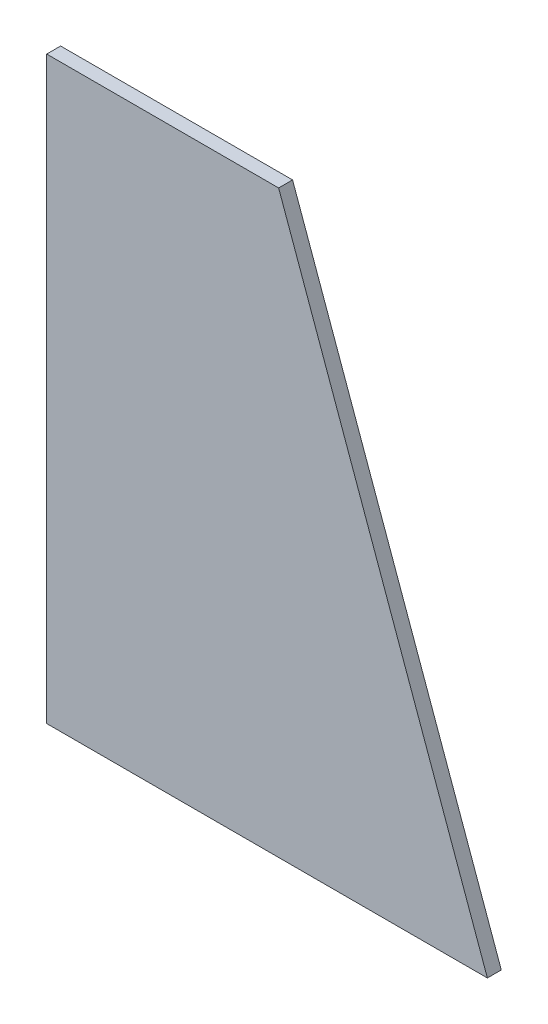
from build123d import *

# Parameters (mm, degrees)
BOSS_EXTRUDE1_DEPTH = 6


with BuildPart() as part:
    # Sketch1 → Boss-Extrude1 (new body)
    with BuildSketch(Plane.XY):
        Polygon((0, 250), (0, 0), (190, 0), (100, 250), align=None)
    extrude(amount=BOSS_EXTRUDE1_DEPTH)


solid = part.part
